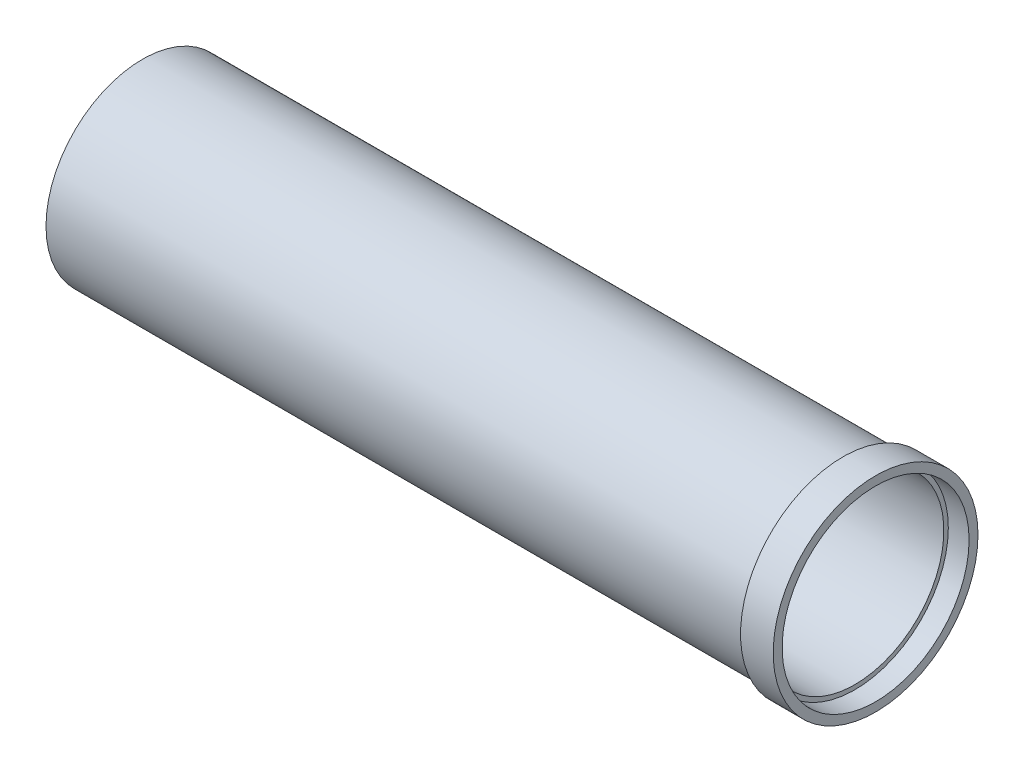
ISO-10303-21;
HEADER;
FILE_DESCRIPTION(('STEP AP214'),'2;1');
FILE_NAME('part.step','',(''),(''),'','','');
FILE_SCHEMA(('AUTOMOTIVE_DESIGN { 1 0 10303 214 1 1 1 1 }'));
ENDSEC;
DATA;
#1=APPLICATION_CONTEXT('core data for automotive mechanical design processes');
#2=APPLICATION_PROTOCOL_DEFINITION('international standard','automotive_design',2000,#1);
#3=PRODUCT_CONTEXT('',#1,'mechanical');
#4=PRODUCT('Part','Part','',(#3));
#5=PRODUCT_RELATED_PRODUCT_CATEGORY('part','',(#4));
#6=PRODUCT_DEFINITION_FORMATION('','',#4);
#7=PRODUCT_DEFINITION_CONTEXT('part definition',#1,'design');
#8=PRODUCT_DEFINITION('design','',#6,#7);
#9=PRODUCT_DEFINITION_SHAPE('','',#8);
#10=(LENGTH_UNIT() NAMED_UNIT(*) SI_UNIT(.MILLI.,.METRE.));
#11=(NAMED_UNIT(*) PLANE_ANGLE_UNIT() SI_UNIT($,.RADIAN.));
#12=(NAMED_UNIT(*) SI_UNIT($,.STERADIAN.) SOLID_ANGLE_UNIT());
#13=UNCERTAINTY_MEASURE_WITH_UNIT(LENGTH_MEASURE(1.E-05),#10,'distance_accuracy_value','');
#14=(GEOMETRIC_REPRESENTATION_CONTEXT(3) GLOBAL_UNCERTAINTY_ASSIGNED_CONTEXT((#13)) GLOBAL_UNIT_ASSIGNED_CONTEXT((#10,
#11,#12)) REPRESENTATION_CONTEXT('',''));
#15=CARTESIAN_POINT('',(0.,0.,0.));
#16=DIRECTION('',(0.,0.,1.));
#17=DIRECTION('',(1.,0.,0.));
#18=AXIS2_PLACEMENT_3D('',#15,#16,#17);
#19=CARTESIAN_POINT('',(152.4,0.,0.));
#20=DIRECTION('',(-1.,0.,0.));
#21=DIRECTION('',(0.,0.,1.));
#22=AXIS2_PLACEMENT_3D('',#19,#20,#21);
#23=CYLINDRICAL_SURFACE('',#22,41.275);
#24=CARTESIAN_POINT('',(-152.4,0.,0.));
#25=DIRECTION('',(1.,0.,0.));
#26=DIRECTION('',(0.,0.,-1.));
#27=AXIS2_PLACEMENT_3D('',#24,#25,#26);
#28=CIRCLE('',#27,41.275);
#29=CARTESIAN_POINT('',(-152.4,0.,41.275));
#30=VERTEX_POINT('',#29);
#31=EDGE_CURVE('E45',#30,#30,#28,.T.);
#32=CARTESIAN_POINT('',(147.32,0.,0.));
#33=DIRECTION('',(1.,0.,0.));
#34=DIRECTION('',(0.,0.,-1.));
#35=AXIS2_PLACEMENT_3D('',#32,#33,#34);
#36=CIRCLE('',#35,41.275);
#37=CARTESIAN_POINT('',(147.32,0.,41.275));
#38=VERTEX_POINT('',#37);
#39=EDGE_CURVE('E41',#38,#38,#36,.T.);
#40=CARTESIAN_POINT('',(-152.4,0.,41.275));
#41=CARTESIAN_POINT('',(-149.277916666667,0.,41.275));
#42=CARTESIAN_POINT('',(-146.155833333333,0.,41.275));
#43=CARTESIAN_POINT('',(-139.911666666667,0.,41.275));
#44=CARTESIAN_POINT('',(-136.789583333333,0.,41.275));
#45=CARTESIAN_POINT('',(-130.545416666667,0.,41.275));
#46=CARTESIAN_POINT('',(-127.423333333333,0.,41.275));
#47=CARTESIAN_POINT('',(-121.179166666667,0.,41.275));
#48=CARTESIAN_POINT('',(-118.057083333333,0.,41.275));
#49=CARTESIAN_POINT('',(-111.812916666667,0.,41.275));
#50=CARTESIAN_POINT('',(-108.690833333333,0.,41.275));
#51=CARTESIAN_POINT('',(-102.446666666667,0.,41.275));
#52=CARTESIAN_POINT('',(-99.3245833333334,0.,41.275));
#53=CARTESIAN_POINT('',(-93.0804166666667,0.,41.275));
#54=CARTESIAN_POINT('',(-89.9583333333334,0.,41.275));
#55=CARTESIAN_POINT('',(-83.7141666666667,0.,41.275));
#56=CARTESIAN_POINT('',(-80.5920833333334,0.,41.275));
#57=CARTESIAN_POINT('',(-74.3479166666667,0.,41.275));
#58=CARTESIAN_POINT('',(-71.2258333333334,0.,41.275));
#59=CARTESIAN_POINT('',(-64.9816666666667,0.,41.275));
#60=CARTESIAN_POINT('',(-61.8595833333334,0.,41.275));
#61=CARTESIAN_POINT('',(-55.6154166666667,0.,41.275));
#62=CARTESIAN_POINT('',(-52.4933333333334,0.,41.275));
#63=CARTESIAN_POINT('',(-46.2491666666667,0.,41.275));
#64=CARTESIAN_POINT('',(-43.1270833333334,0.,41.275));
#65=CARTESIAN_POINT('',(-36.8829166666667,0.,41.275));
#66=CARTESIAN_POINT('',(-33.7608333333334,0.,41.275));
#67=CARTESIAN_POINT('',(-27.5166666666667,0.,41.275));
#68=CARTESIAN_POINT('',(-24.3945833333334,0.,41.275));
#69=CARTESIAN_POINT('',(-18.1504166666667,0.,41.275));
#70=CARTESIAN_POINT('',(-15.0283333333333,0.,41.275));
#71=CARTESIAN_POINT('',(-8.78416666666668,0.,41.275));
#72=CARTESIAN_POINT('',(-5.66208333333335,0.,41.275));
#73=CARTESIAN_POINT('',(0.582083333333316,0.,41.275));
#74=CARTESIAN_POINT('',(3.70416666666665,0.,41.275));
#75=CARTESIAN_POINT('',(9.94833333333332,0.,41.275));
#76=CARTESIAN_POINT('',(13.0704166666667,0.,41.275));
#77=CARTESIAN_POINT('',(19.3145833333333,0.,41.275));
#78=CARTESIAN_POINT('',(22.4366666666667,0.,41.275));
#79=CARTESIAN_POINT('',(28.6808333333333,0.,41.275));
#80=CARTESIAN_POINT('',(31.8029166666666,0.,41.275));
#81=CARTESIAN_POINT('',(38.0470833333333,0.,41.275));
#82=CARTESIAN_POINT('',(41.1691666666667,0.,41.275));
#83=CARTESIAN_POINT('',(47.4133333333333,0.,41.275));
#84=CARTESIAN_POINT('',(50.5354166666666,0.,41.275));
#85=CARTESIAN_POINT('',(56.7795833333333,0.,41.275));
#86=CARTESIAN_POINT('',(59.9016666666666,0.,41.275));
#87=CARTESIAN_POINT('',(66.1458333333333,0.,41.275));
#88=CARTESIAN_POINT('',(69.2679166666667,0.,41.275));
#89=CARTESIAN_POINT('',(75.5120833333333,0.,41.275));
#90=CARTESIAN_POINT('',(78.6341666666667,0.,41.275));
#91=CARTESIAN_POINT('',(84.8783333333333,0.,41.275));
#92=CARTESIAN_POINT('',(88.0004166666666,0.,41.275));
#93=CARTESIAN_POINT('',(94.2445833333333,0.,41.275));
#94=CARTESIAN_POINT('',(97.3666666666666,0.,41.275));
#95=CARTESIAN_POINT('',(103.610833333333,0.,41.275));
#96=CARTESIAN_POINT('',(106.732916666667,0.,41.275));
#97=CARTESIAN_POINT('',(112.977083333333,0.,41.275));
#98=CARTESIAN_POINT('',(116.099166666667,0.,41.275));
#99=CARTESIAN_POINT('',(122.343333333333,0.,41.275));
#100=CARTESIAN_POINT('',(125.465416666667,0.,41.275));
#101=CARTESIAN_POINT('',(131.709583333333,0.,41.275));
#102=CARTESIAN_POINT('',(134.831666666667,0.,41.275));
#103=CARTESIAN_POINT('',(141.075833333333,0.,41.275));
#104=CARTESIAN_POINT('',(144.197916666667,0.,41.275));
#105=CARTESIAN_POINT('',(147.32,0.,41.275));
#106=B_SPLINE_CURVE_WITH_KNOTS('',3,(#40,#41,#42,#43,#44,#45,#46,#47,#48,#49,#50,#51,#52,#53,
#54,#55,#56,#57,#58,#59,#60,#61,#62,#63,#64,#65,#66,#67,#68,#69,#70,#71,#72,#73,#74,#75,#76,#77,
#78,#79,#80,#81,#82,#83,#84,#85,#86,#87,#88,#89,#90,#91,#92,#93,#94,#95,#96,#97,#98,#99,#100,
#101,#102,#103,#104,#105),.UNSPECIFIED.,.F.,.F.,(4,2,2,2,2,2,2,2,2,2,2,2,2,2,2,2,2,2,2,2,2,2,2,
2,2,2,2,2,2,2,2,2,4),(0.,9.36625000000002,18.7325,28.09875,37.465,46.83125,56.1975,65.56375,
74.93,84.29625,93.6625,103.02875,112.395,121.76125,131.1275,140.49375,149.86,159.22625,168.5925,
177.95875,187.325,196.69125,206.0575,215.42375,224.79,234.15625,243.5225,252.88875,262.255,
271.62125,280.9875,290.35375,299.72),.UNSPECIFIED.);
#107=EDGE_CURVE('BSEAM35',#30,#38,#106,.T.);
#108=ORIENTED_EDGE('',*,*,#31,.T.);
#109=ORIENTED_EDGE('',*,*,#39,.F.);
#110=ORIENTED_EDGE('',*,*,#107,.T.);
#111=ORIENTED_EDGE('',*,*,#107,.F.);
#112=EDGE_LOOP('',(#108,#110,#109,#111));
#113=FACE_BOUND('',#112,.T.);
#114=ADVANCED_FACE('F35',(#113),#23,.T.);
#115=CARTESIAN_POINT('',(152.4,0.,0.));
#116=DIRECTION('',(1.,0.,0.));
#117=DIRECTION('',(0.,0.,-1.));
#118=AXIS2_PLACEMENT_3D('',#115,#116,#117);
#119=PLANE('',#118);
#120=CARTESIAN_POINT('',(152.4,0.,0.));
#121=DIRECTION('',(1.,0.,0.));
#122=DIRECTION('',(0.,0.,-1.));
#123=AXIS2_PLACEMENT_3D('',#120,#121,#122);
#124=CIRCLE('',#123,40.005);
#125=CARTESIAN_POINT('',(152.4,0.,-40.005));
#126=VERTEX_POINT('',#125);
#127=EDGE_CURVE('E11',#126,#126,#124,.F.);
#128=ORIENTED_EDGE('',*,*,#127,.F.);
#129=EDGE_LOOP('',(#128));
#130=FACE_BOUND('',#129,.T.);
#131=CARTESIAN_POINT('',(152.4,0.,0.));
#132=DIRECTION('',(1.,0.,0.));
#133=DIRECTION('',(0.,0.,-1.));
#134=AXIS2_PLACEMENT_3D('',#131,#132,#133);
#135=CIRCLE('',#134,38.1);
#136=CARTESIAN_POINT('',(152.4,0.,38.1));
#137=VERTEX_POINT('',#136);
#138=EDGE_CURVE('E49',#137,#137,#135,.T.);
#139=ORIENTED_EDGE('',*,*,#138,.F.);
#140=EDGE_LOOP('',(#139));
#141=FACE_BOUND('',#140,.T.);
#142=ADVANCED_FACE('F85',(#130,#141),#119,.T.);
#143=CARTESIAN_POINT('',(-152.4,0.,0.));
#144=DIRECTION('',(1.,0.,0.));
#145=DIRECTION('',(0.,0.,-1.));
#146=AXIS2_PLACEMENT_3D('',#143,#144,#145);
#147=PLANE('',#146);
#148=ORIENTED_EDGE('',*,*,#31,.F.);
#149=EDGE_LOOP('',(#148));
#150=FACE_BOUND('',#149,.T.);
#151=CARTESIAN_POINT('',(-152.4,0.,0.));
#152=DIRECTION('',(1.,0.,0.));
#153=DIRECTION('',(0.,0.,-1.));
#154=AXIS2_PLACEMENT_3D('',#151,#152,#153);
#155=CIRCLE('',#154,38.1);
#156=CARTESIAN_POINT('',(-152.4,0.,38.1));
#157=VERTEX_POINT('',#156);
#158=EDGE_CURVE('E52',#157,#157,#155,.T.);
#159=ORIENTED_EDGE('',*,*,#158,.T.);
#160=EDGE_LOOP('',(#159));
#161=FACE_BOUND('',#160,.T.);
#162=ADVANCED_FACE('F80',(#150,#161),#147,.F.);
#163=CARTESIAN_POINT('',(152.4,0.,0.));
#164=DIRECTION('',(-1.,0.,0.));
#165=DIRECTION('',(0.,0.,1.));
#166=AXIS2_PLACEMENT_3D('',#163,#164,#165);
#167=CYLINDRICAL_SURFACE('',#166,38.1);
#168=CARTESIAN_POINT('',(152.4,0.,38.1));
#169=CARTESIAN_POINT('',(149.225,0.,38.1));
#170=CARTESIAN_POINT('',(146.05,0.,38.1));
#171=CARTESIAN_POINT('',(139.7,0.,38.1));
#172=CARTESIAN_POINT('',(136.525,0.,38.1));
#173=CARTESIAN_POINT('',(130.175,0.,38.1));
#174=CARTESIAN_POINT('',(127.,0.,38.1));
#175=CARTESIAN_POINT('',(120.65,0.,38.1));
#176=CARTESIAN_POINT('',(117.475,0.,38.1));
#177=CARTESIAN_POINT('',(111.125,0.,38.1));
#178=CARTESIAN_POINT('',(107.95,0.,38.1));
#179=CARTESIAN_POINT('',(101.6,0.,38.1));
#180=CARTESIAN_POINT('',(98.425,0.,38.1));
#181=CARTESIAN_POINT('',(92.075,0.,38.1));
#182=CARTESIAN_POINT('',(88.9,0.,38.1));
#183=CARTESIAN_POINT('',(82.55,0.,38.1));
#184=CARTESIAN_POINT('',(79.375,0.,38.1));
#185=CARTESIAN_POINT('',(73.025,0.,38.1));
#186=CARTESIAN_POINT('',(69.85,0.,38.1));
#187=CARTESIAN_POINT('',(63.5,0.,38.1));
#188=CARTESIAN_POINT('',(60.325,0.,38.1));
#189=CARTESIAN_POINT('',(53.975,0.,38.1));
#190=CARTESIAN_POINT('',(50.8,0.,38.1));
#191=CARTESIAN_POINT('',(44.45,0.,38.1));
#192=CARTESIAN_POINT('',(41.275,0.,38.1));
#193=CARTESIAN_POINT('',(34.925,0.,38.1));
#194=CARTESIAN_POINT('',(31.75,0.,38.1));
#195=CARTESIAN_POINT('',(25.4,0.,38.1));
#196=CARTESIAN_POINT('',(22.225,0.,38.1));
#197=CARTESIAN_POINT('',(15.875,0.,38.1));
#198=CARTESIAN_POINT('',(12.7,0.,38.1));
#199=CARTESIAN_POINT('',(6.35,0.,38.1));
#200=CARTESIAN_POINT('',(3.175,0.,38.1));
#201=CARTESIAN_POINT('',(-3.175,0.,38.1));
#202=CARTESIAN_POINT('',(-6.35,0.,38.1));
#203=CARTESIAN_POINT('',(-12.7,0.,38.1));
#204=CARTESIAN_POINT('',(-15.875,0.,38.1));
#205=CARTESIAN_POINT('',(-22.225,0.,38.1));
#206=CARTESIAN_POINT('',(-25.4,0.,38.1));
#207=CARTESIAN_POINT('',(-31.75,0.,38.1));
#208=CARTESIAN_POINT('',(-34.925,0.,38.1));
#209=CARTESIAN_POINT('',(-41.275,0.,38.1));
#210=CARTESIAN_POINT('',(-44.45,0.,38.1));
#211=CARTESIAN_POINT('',(-50.8,0.,38.1));
#212=CARTESIAN_POINT('',(-53.975,0.,38.1));
#213=CARTESIAN_POINT('',(-60.325,0.,38.1));
#214=CARTESIAN_POINT('',(-63.5,0.,38.1));
#215=CARTESIAN_POINT('',(-69.85,0.,38.1));
#216=CARTESIAN_POINT('',(-73.025,0.,38.1));
#217=CARTESIAN_POINT('',(-79.375,0.,38.1));
#218=CARTESIAN_POINT('',(-82.55,0.,38.1));
#219=CARTESIAN_POINT('',(-88.9,0.,38.1));
#220=CARTESIAN_POINT('',(-92.075,0.,38.1));
#221=CARTESIAN_POINT('',(-98.425,0.,38.1));
#222=CARTESIAN_POINT('',(-101.6,0.,38.1));
#223=CARTESIAN_POINT('',(-107.95,0.,38.1));
#224=CARTESIAN_POINT('',(-111.125,0.,38.1));
#225=CARTESIAN_POINT('',(-117.475,0.,38.1));
#226=CARTESIAN_POINT('',(-120.65,0.,38.1));
#227=CARTESIAN_POINT('',(-127.,0.,38.1));
#228=CARTESIAN_POINT('',(-130.175,0.,38.1));
#229=CARTESIAN_POINT('',(-136.525,0.,38.1));
#230=CARTESIAN_POINT('',(-139.7,0.,38.1));
#231=CARTESIAN_POINT('',(-146.05,0.,38.1));
#232=CARTESIAN_POINT('',(-149.225,0.,38.1));
#233=CARTESIAN_POINT('',(-152.4,0.,38.1));
#234=B_SPLINE_CURVE_WITH_KNOTS('',3,(#168,#169,#170,#171,#172,#173,#174,#175,#176,#177,#178,
#179,#180,#181,#182,#183,#184,#185,#186,#187,#188,#189,#190,#191,#192,#193,#194,#195,#196,#197,
#198,#199,#200,#201,#202,#203,#204,#205,#206,#207,#208,#209,#210,#211,#212,#213,#214,#215,#216,
#217,#218,#219,#220,#221,#222,#223,#224,#225,#226,#227,#228,#229,#230,#231,#232,#233),
.UNSPECIFIED.,.F.,.F.,(4,2,2,2,2,2,2,2,2,2,2,2,2,2,2,2,2,2,2,2,2,2,2,2,2,2,2,2,2,2,2,2,4),(0.,
9.52500000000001,19.05,28.575,38.1,47.625,57.15,66.675,76.2,85.725,95.25,104.775,114.3,123.825,
133.35,142.875,152.4,161.925,171.45,180.975,190.5,200.025,209.55,219.075,228.6,238.125,247.65,
257.175,266.7,276.225,285.75,295.275,304.8),.UNSPECIFIED.);
#235=EDGE_CURVE('BSEAM72',#137,#157,#234,.T.);
#236=ORIENTED_EDGE('',*,*,#138,.T.);
#237=ORIENTED_EDGE('',*,*,#158,.F.);
#238=ORIENTED_EDGE('',*,*,#235,.T.);
#239=ORIENTED_EDGE('',*,*,#235,.F.);
#240=EDGE_LOOP('',(#236,#238,#237,#239));
#241=FACE_BOUND('',#240,.T.);
#242=ADVANCED_FACE('F72',(#241),#167,.F.);
#243=CARTESIAN_POINT('',(147.32,0.,0.));
#244=DIRECTION('',(1.,0.,0.));
#245=DIRECTION('',(0.,0.,-1.));
#246=AXIS2_PLACEMENT_3D('',#243,#244,#245);
#247=PLANE('',#246);
#248=CARTESIAN_POINT('',(147.32,0.,0.));
#249=DIRECTION('',(1.,0.,0.));
#250=DIRECTION('',(0.,0.,-1.));
#251=AXIS2_PLACEMENT_3D('',#248,#249,#250);
#252=CIRCLE('',#251,43.815);
#253=CARTESIAN_POINT('',(147.32,0.,-43.815));
#254=VERTEX_POINT('',#253);
#255=EDGE_CURVE('E63',#254,#254,#252,.T.);
#256=ORIENTED_EDGE('',*,*,#255,.F.);
#257=EDGE_LOOP('',(#256));
#258=FACE_BOUND('',#257,.T.);
#259=ORIENTED_EDGE('',*,*,#39,.T.);
#260=EDGE_LOOP('',(#259));
#261=FACE_BOUND('',#260,.T.);
#262=ADVANCED_FACE('F69',(#258,#261),#247,.F.);
#263=CARTESIAN_POINT('',(161.29,0.,0.));
#264=DIRECTION('',(1.,0.,0.));
#265=DIRECTION('',(0.,0.,-1.));
#266=AXIS2_PLACEMENT_3D('',#263,#264,#265);
#267=PLANE('',#266);
#268=CARTESIAN_POINT('',(161.29,0.,0.));
#269=DIRECTION('',(1.,0.,0.));
#270=DIRECTION('',(0.,0.,-1.));
#271=AXIS2_PLACEMENT_3D('',#268,#269,#270);
#272=CIRCLE('',#271,43.815);
#273=CARTESIAN_POINT('',(161.29,0.,-43.815));
#274=VERTEX_POINT('',#273);
#275=EDGE_CURVE('E55',#274,#274,#272,.T.);
#276=ORIENTED_EDGE('',*,*,#275,.T.);
#277=EDGE_LOOP('',(#276));
#278=FACE_BOUND('',#277,.T.);
#279=CARTESIAN_POINT('',(161.29,0.,0.));
#280=DIRECTION('',(1.,0.,0.));
#281=DIRECTION('',(0.,0.,-1.));
#282=AXIS2_PLACEMENT_3D('',#279,#280,#281);
#283=CIRCLE('',#282,40.005);
#284=CARTESIAN_POINT('',(161.29,0.,-40.005));
#285=VERTEX_POINT('',#284);
#286=EDGE_CURVE('E60',#285,#285,#283,.T.);
#287=ORIENTED_EDGE('',*,*,#286,.F.);
#288=EDGE_LOOP('',(#287));
#289=FACE_BOUND('',#288,.T.);
#290=ADVANCED_FACE('F71',(#278,#289),#267,.T.);
#291=CARTESIAN_POINT('',(161.29,0.,0.));
#292=DIRECTION('',(-1.,0.,0.));
#293=DIRECTION('',(0.,0.,1.));
#294=AXIS2_PLACEMENT_3D('',#291,#292,#293);
#295=CYLINDRICAL_SURFACE('',#294,43.815);
#296=ORIENTED_EDGE('',*,*,#275,.F.);
#297=EDGE_LOOP('',(#296));
#298=FACE_BOUND('',#297,.T.);
#299=ORIENTED_EDGE('',*,*,#255,.T.);
#300=EDGE_LOOP('',(#299));
#301=FACE_BOUND('',#300,.T.);
#302=ADVANCED_FACE('F67',(#298,#301),#295,.T.);
#303=CARTESIAN_POINT('',(161.29,0.,0.));
#304=DIRECTION('',(-1.,0.,0.));
#305=DIRECTION('',(0.,0.,1.));
#306=AXIS2_PLACEMENT_3D('',#303,#304,#305);
#307=CYLINDRICAL_SURFACE('',#306,40.005);
#308=ORIENTED_EDGE('',*,*,#127,.T.);
#309=EDGE_LOOP('',(#308));
#310=FACE_BOUND('',#309,.T.);
#311=ORIENTED_EDGE('',*,*,#286,.T.);
#312=EDGE_LOOP('',(#311));
#313=FACE_BOUND('',#312,.T.);
#314=ADVANCED_FACE('F103',(#310,#313),#307,.F.);
#315=CLOSED_SHELL('',(#114,#142,#162,#242,#262,#290,#302,#314));
#316=MANIFOLD_SOLID_BREP('B2',#315);
#317=ADVANCED_BREP_SHAPE_REPRESENTATION('',(#18,#316),#14);
#318=SHAPE_DEFINITION_REPRESENTATION(#9,#317);
ENDSEC;
END-ISO-10303-21;
